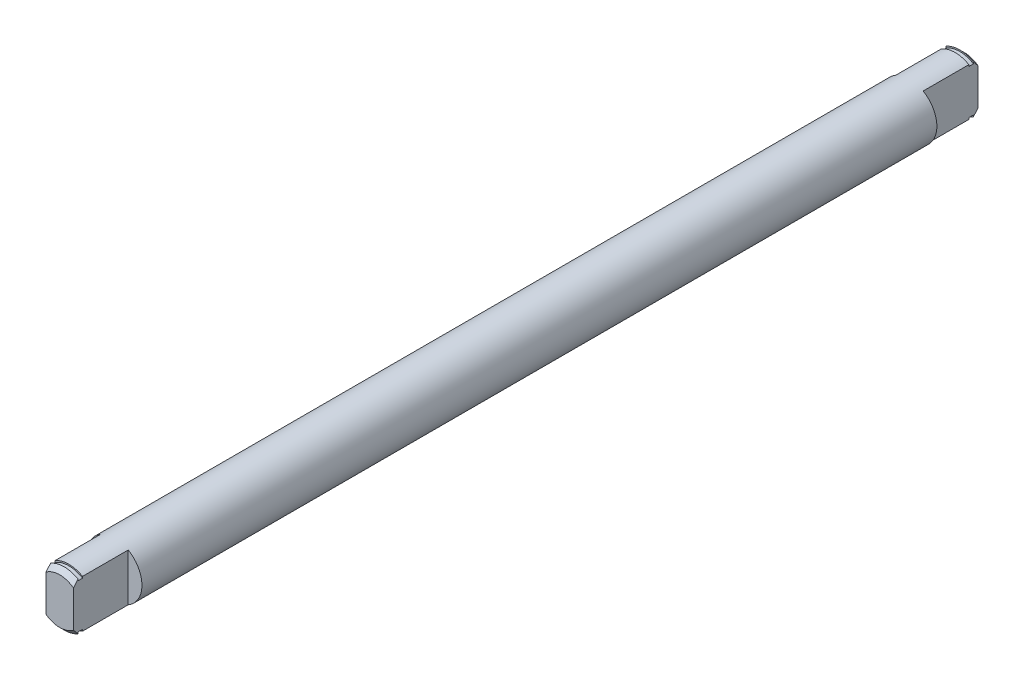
from build123d import *

# Parameters (mm, degrees)
ESQUISSE1_R             = 3
EXTRUSION1_DEPTH        = 49.5
CHANFREIN1_SIZE         = 0.5
ESQUISSE2_W             = 0.5
ESQUISSE2_H             = 1.896207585
ESQUISSE3_OUTSIDE_W     = 18.044
ESQUISSE3_OUTSIDE_H     = 18.044
ESQUISSE3_OUTSIDE_W_2   = 3
ESQUISSE3_OUTSIDE_H_2   = 10
ENL_V_MAT_EXTRU_1_DEPTH = 6


with BuildPart() as part:
    # Esquisse1 → Extrusion1 (new body)
    with BuildSketch(Plane.XY):
        Circle(ESQUISSE1_R)
    extrude(amount=EXTRUSION1_DEPTH)

    # Chanfrein1
    chanfrein1_edges = [part.edges().sort_by_distance(p)[0] for p in [
        (-3, 0, 49.5),
    ]]
    chamfer(chanfrein1_edges, length=CHANFREIN1_SIZE)

    # Esquisse2 → Enl_vement de mati_re-R_volution1 (revolve, cut)
    with BuildSketch(Plane(origin=(0, 0, 0), x_dir=(0, 0, -1), z_dir=(1, 0, 0)), mode=Mode.PRIVATE) as enl_vement_de_mati_re_r_volution1_sk:
        with Locations((-48.75, 3.798103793)):
            Rectangle(ESQUISSE2_W, ESQUISSE2_H)
    revolve(enl_vement_de_mati_re_r_volution1_sk.sketch.rotate(Axis((0, 0, 0), (0, 0, 1)), 90), axis=Axis((0, 0, 0), (0, 0, 1)), mode=Mode.SUBTRACT)

    # Esquisse3 outside → Enl_v. mat.-Extru.1 (cut)
    with BuildSketch(Plane.XY.offset(49.5)):
        Rectangle(ESQUISSE3_OUTSIDE_W, ESQUISSE3_OUTSIDE_H)
        Rectangle(ESQUISSE3_OUTSIDE_W_2, ESQUISSE3_OUTSIDE_H_2, mode=Mode.SUBTRACT)
    extrude(amount=-ENL_V_MAT_EXTRU_1_DEPTH, mode=Mode.SUBTRACT)

    # Sym_trie1: part across plane


with BuildPart() as part_1:
    add(part.part)
    add(part.part.mirror(Plane.XY))


solid = part_1.part
